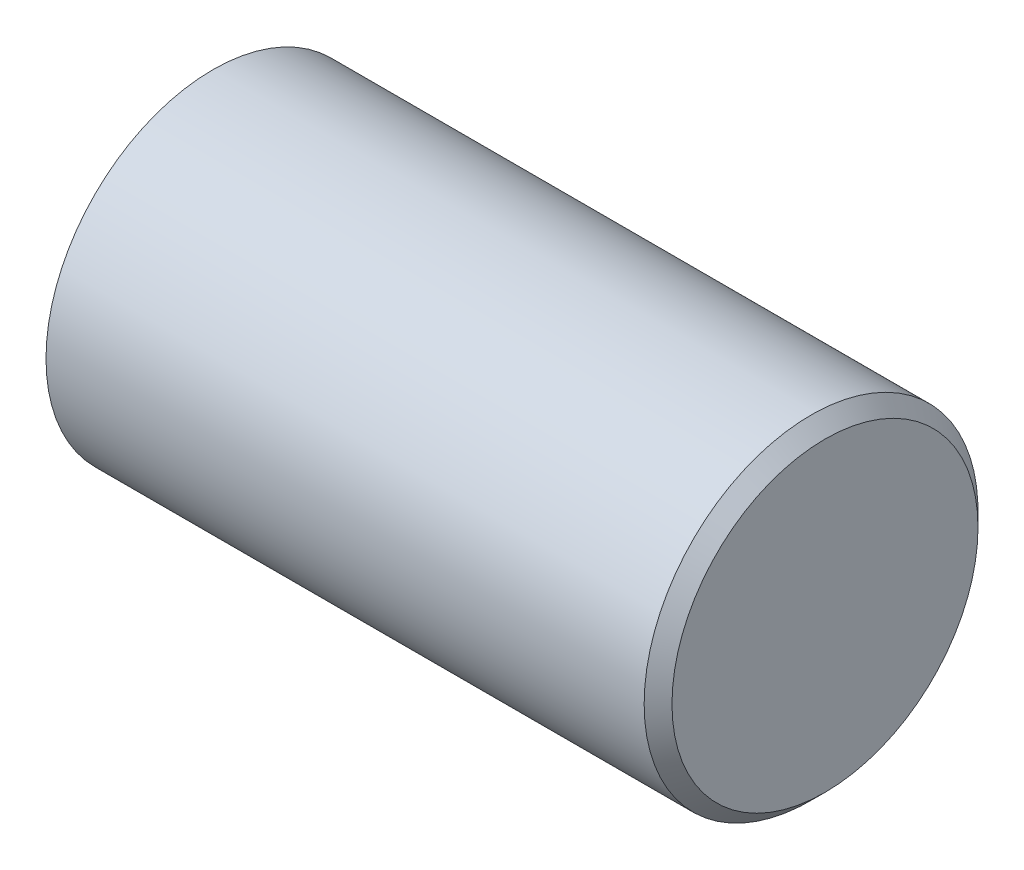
ISO-10303-21;
HEADER;
FILE_DESCRIPTION(('STEP AP214'),'2;1');
FILE_NAME('part.step','',(''),(''),'','','');
FILE_SCHEMA(('AUTOMOTIVE_DESIGN { 1 0 10303 214 1 1 1 1 }'));
ENDSEC;
DATA;
#1=APPLICATION_CONTEXT('core data for automotive mechanical design processes');
#2=APPLICATION_PROTOCOL_DEFINITION('international standard','automotive_design',2000,#1);
#3=PRODUCT_CONTEXT('',#1,'mechanical');
#4=PRODUCT('Part','Part','',(#3));
#5=PRODUCT_RELATED_PRODUCT_CATEGORY('part','',(#4));
#6=PRODUCT_DEFINITION_FORMATION('','',#4);
#7=PRODUCT_DEFINITION_CONTEXT('part definition',#1,'design');
#8=PRODUCT_DEFINITION('design','',#6,#7);
#9=PRODUCT_DEFINITION_SHAPE('','',#8);
#10=(LENGTH_UNIT() NAMED_UNIT(*) SI_UNIT(.MILLI.,.METRE.));
#11=(NAMED_UNIT(*) PLANE_ANGLE_UNIT() SI_UNIT($,.RADIAN.));
#12=(NAMED_UNIT(*) SI_UNIT($,.STERADIAN.) SOLID_ANGLE_UNIT());
#13=UNCERTAINTY_MEASURE_WITH_UNIT(LENGTH_MEASURE(1.E-05),#10,'distance_accuracy_value','');
#14=(GEOMETRIC_REPRESENTATION_CONTEXT(3) GLOBAL_UNCERTAINTY_ASSIGNED_CONTEXT((#13)) GLOBAL_UNIT_ASSIGNED_CONTEXT((#10,
#11,#12)) REPRESENTATION_CONTEXT('',''));
#15=CARTESIAN_POINT('',(0.,0.,0.));
#16=DIRECTION('',(0.,0.,1.));
#17=DIRECTION('',(1.,0.,0.));
#18=AXIS2_PLACEMENT_3D('',#15,#16,#17);
#19=CARTESIAN_POINT('',(10.,0.,0.));
#20=DIRECTION('',(-1.,0.,0.));
#21=DIRECTION('',(0.,1.,0.));
#22=AXIS2_PLACEMENT_3D('',#19,#20,#21);
#23=SPHERICAL_SURFACE('',#22,10.);
#24=CARTESIAN_POINT('',(2.,0.,0.));
#25=DIRECTION('',(-1.,0.,0.));
#26=DIRECTION('',(0.,0.,1.));
#27=AXIS2_PLACEMENT_3D('',#24,#25,#26);
#28=CIRCLE('',#27,6.);
#29=CARTESIAN_POINT('',(2.,0.,6.));
#30=VERTEX_POINT('',#29);
#31=EDGE_CURVE('E47',#30,#30,#28,.T.);
#32=ORIENTED_EDGE('',*,*,#31,.T.);
#33=EDGE_LOOP('',(#32));
#34=FACE_BOUND('',#33,.T.);
#35=ADVANCED_FACE('F36',(#34),#23,.T.);
#36=CARTESIAN_POINT('',(24.,0.,0.));
#37=DIRECTION('',(-1.,0.,0.));
#38=DIRECTION('',(0.,0.,1.));
#39=AXIS2_PLACEMENT_3D('',#36,#37,#38);
#40=PLANE('',#39);
#41=CARTESIAN_POINT('',(24.,0.,0.));
#42=DIRECTION('',(-1.,0.,0.));
#43=DIRECTION('',(0.,0.,1.));
#44=AXIS2_PLACEMENT_3D('',#41,#42,#43);
#45=CIRCLE('',#44,5.49999999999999);
#46=CARTESIAN_POINT('',(24.,0.,5.49999999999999));
#47=VERTEX_POINT('',#46);
#48=EDGE_CURVE('E10',#47,#47,#45,.F.);
#49=ORIENTED_EDGE('',*,*,#48,.T.);
#50=EDGE_LOOP('',(#49));
#51=FACE_BOUND('',#50,.T.);
#52=ADVANCED_FACE('F57',(#51),#40,.F.);
#53=CARTESIAN_POINT('',(0.,0.,0.));
#54=DIRECTION('',(-1.,0.,0.));
#55=DIRECTION('',(0.,0.,1.));
#56=AXIS2_PLACEMENT_3D('',#53,#54,#55);
#57=CYLINDRICAL_SURFACE('',#56,6.);
#58=CARTESIAN_POINT('',(23.5,0.,0.));
#59=DIRECTION('',(-1.,0.,0.));
#60=DIRECTION('',(0.,0.,1.));
#61=AXIS2_PLACEMENT_3D('',#58,#59,#60);
#62=CIRCLE('',#61,6.);
#63=CARTESIAN_POINT('',(23.5,0.,6.));
#64=VERTEX_POINT('',#63);
#65=EDGE_CURVE('E43',#64,#64,#62,.T.);
#66=ORIENTED_EDGE('',*,*,#65,.T.);
#67=EDGE_LOOP('',(#66));
#68=FACE_BOUND('',#67,.T.);
#69=ORIENTED_EDGE('',*,*,#31,.F.);
#70=EDGE_LOOP('',(#69));
#71=FACE_BOUND('',#70,.T.);
#72=ADVANCED_FACE('F55',(#68,#71),#57,.T.);
#73=CARTESIAN_POINT('',(23.5,0.,0.));
#74=DIRECTION('',(-1.,0.,0.));
#75=DIRECTION('',(0.,0.,1.));
#76=AXIS2_PLACEMENT_3D('',#73,#74,#75);
#77=CONICAL_SURFACE('',#76,6.,0.785398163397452);
#78=ORIENTED_EDGE('',*,*,#48,.F.);
#79=EDGE_LOOP('',(#78));
#80=FACE_BOUND('',#79,.T.);
#81=ORIENTED_EDGE('',*,*,#65,.F.);
#82=EDGE_LOOP('',(#81));
#83=FACE_BOUND('',#82,.T.);
#84=ADVANCED_FACE('F38',(#80,#83),#77,.T.);
#85=CLOSED_SHELL('',(#35,#52,#72,#84));
#86=MANIFOLD_SOLID_BREP('B2',#85);
#87=ADVANCED_BREP_SHAPE_REPRESENTATION('',(#18,#86),#14);
#88=SHAPE_DEFINITION_REPRESENTATION(#9,#87);
ENDSEC;
END-ISO-10303-21;
